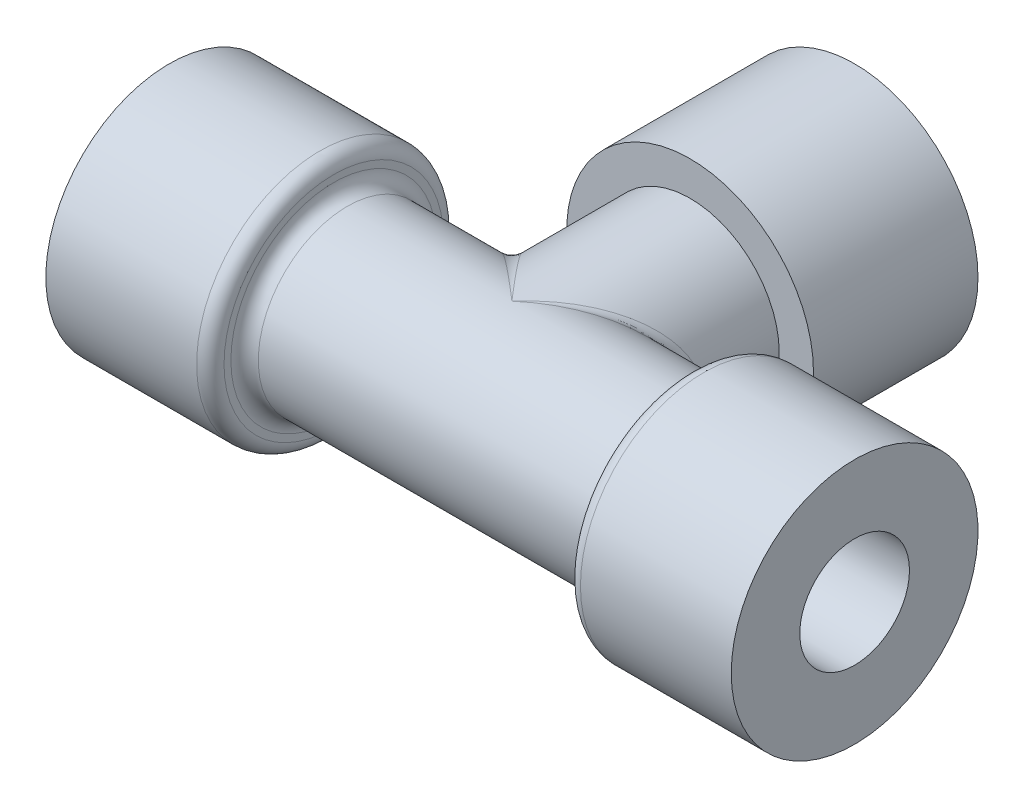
ISO-10303-21;
HEADER;
FILE_DESCRIPTION(('STEP AP214'),'2;1');
FILE_NAME('part.step','',(''),(''),'','','');
FILE_SCHEMA(('AUTOMOTIVE_DESIGN { 1 0 10303 214 1 1 1 1 }'));
ENDSEC;
DATA;
#1=APPLICATION_CONTEXT('core data for automotive mechanical design processes');
#2=APPLICATION_PROTOCOL_DEFINITION('international standard','automotive_design',2000,#1);
#3=PRODUCT_CONTEXT('',#1,'mechanical');
#4=PRODUCT('Part','Part','',(#3));
#5=PRODUCT_RELATED_PRODUCT_CATEGORY('part','',(#4));
#6=PRODUCT_DEFINITION_FORMATION('','',#4);
#7=PRODUCT_DEFINITION_CONTEXT('part definition',#1,'design');
#8=PRODUCT_DEFINITION('design','',#6,#7);
#9=PRODUCT_DEFINITION_SHAPE('','',#8);
#10=(LENGTH_UNIT() NAMED_UNIT(*) SI_UNIT(.MILLI.,.METRE.));
#11=(NAMED_UNIT(*) PLANE_ANGLE_UNIT() SI_UNIT($,.RADIAN.));
#12=(NAMED_UNIT(*) SI_UNIT($,.STERADIAN.) SOLID_ANGLE_UNIT());
#13=UNCERTAINTY_MEASURE_WITH_UNIT(LENGTH_MEASURE(1.E-05),#10,'distance_accuracy_value','');
#14=(GEOMETRIC_REPRESENTATION_CONTEXT(3) GLOBAL_UNCERTAINTY_ASSIGNED_CONTEXT((#13)) GLOBAL_UNIT_ASSIGNED_CONTEXT((#10,
#11,#12)) REPRESENTATION_CONTEXT('',''));
#15=CARTESIAN_POINT('',(0.,0.,0.));
#16=DIRECTION('',(0.,0.,1.));
#17=DIRECTION('',(1.,0.,0.));
#18=AXIS2_PLACEMENT_3D('',#15,#16,#17);
#19=CARTESIAN_POINT('',(0.,0.,0.));
#20=DIRECTION('',(1.,0.,0.));
#21=DIRECTION('',(0.,0.,-1.));
#22=AXIS2_PLACEMENT_3D('',#19,#20,#21);
#23=CYLINDRICAL_SURFACE('',#22,6.5);
#24=CARTESIAN_POINT('',(12.,0.,0.));
#25=DIRECTION('',(-1.,0.,0.));
#26=DIRECTION('',(0.,0.,1.));
#27=AXIS2_PLACEMENT_3D('',#24,#25,#26);
#28=CIRCLE('',#27,6.5);
#29=CARTESIAN_POINT('',(12.,0.,6.5));
#30=VERTEX_POINT('',#29);
#31=EDGE_CURVE('E123',#30,#30,#28,.T.);
#32=ORIENTED_EDGE('',*,*,#31,.T.);
#33=EDGE_LOOP('',(#32));
#34=FACE_BOUND('',#33,.T.);
#35=CARTESIAN_POINT('',(-12.,0.,0.));
#36=DIRECTION('',(1.,0.,0.));
#37=DIRECTION('',(0.,0.,-1.));
#38=AXIS2_PLACEMENT_3D('',#35,#36,#37);
#39=CIRCLE('',#38,6.5);
#40=CARTESIAN_POINT('',(-12.,0.,-6.5));
#41=VERTEX_POINT('',#40);
#42=EDGE_CURVE('E120',#41,#41,#39,.T.);
#43=ORIENTED_EDGE('',*,*,#42,.T.);
#44=EDGE_LOOP('',(#43));
#45=FACE_BOUND('',#44,.T.);
#46=CARTESIAN_POINT('',(0.,0.,0.));
#47=DIRECTION('',(0.654930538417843,0.,-0.755689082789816));
#48=DIRECTION('',(0.755689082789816,0.,0.654930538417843));
#49=AXIS2_PLACEMENT_3D('',#46,#47,#48);
#50=ELLIPSE('',#49,9.92471662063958,6.5);
#51=CARTESIAN_POINT('',(0.,6.5,0.));
#52=VERTEX_POINT('',#51);
#53=CARTESIAN_POINT('',(0.,-6.5,0.));
#54=VERTEX_POINT('',#53);
#55=EDGE_CURVE('E115',#52,#54,#50,.F.);
#56=ORIENTED_EDGE('',*,*,#55,.T.);
#57=CARTESIAN_POINT('',(0.,0.,0.));
#58=DIRECTION('',(-0.654930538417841,0.,-0.755689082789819));
#59=DIRECTION('',(0.755689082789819,0.,-0.654930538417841));
#60=AXIS2_PLACEMENT_3D('',#57,#58,#59);
#61=ELLIPSE('',#60,9.92471662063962,6.5);
#62=EDGE_CURVE('E117',#54,#52,#61,.F.);
#63=ORIENTED_EDGE('',*,*,#62,.T.);
#64=EDGE_LOOP('',(#56,#63));
#65=FACE_BOUND('',#64,.T.);
#66=ADVANCED_FACE('F34',(#34,#45,#65),#23,.T.);
#67=CARTESIAN_POINT('',(-13.,6.5,0.));
#68=DIRECTION('',(1.,0.,0.));
#69=DIRECTION('',(0.,0.,-1.));
#70=AXIS2_PLACEMENT_3D('',#67,#68,#69);
#71=PLANE('',#70);
#72=CARTESIAN_POINT('',(-13.,0.,0.));
#73=DIRECTION('',(1.,0.,0.));
#74=DIRECTION('',(0.,0.,-1.));
#75=AXIS2_PLACEMENT_3D('',#72,#73,#74);
#76=CIRCLE('',#75,8.);
#77=CARTESIAN_POINT('',(-13.,0.,-8.));
#78=VERTEX_POINT('',#77);
#79=EDGE_CURVE('E100',#78,#78,#76,.T.);
#80=ORIENTED_EDGE('',*,*,#79,.T.);
#81=EDGE_LOOP('',(#80));
#82=FACE_BOUND('',#81,.T.);
#83=CARTESIAN_POINT('',(-13.,0.,0.));
#84=DIRECTION('',(1.,0.,0.));
#85=DIRECTION('',(0.,0.,-1.));
#86=AXIS2_PLACEMENT_3D('',#83,#84,#85);
#87=CIRCLE('',#86,7.5);
#88=CARTESIAN_POINT('',(-13.,0.,-7.5));
#89=VERTEX_POINT('',#88);
#90=EDGE_CURVE('E97',#89,#89,#87,.F.);
#91=ORIENTED_EDGE('',*,*,#90,.T.);
#92=EDGE_LOOP('',(#91));
#93=FACE_BOUND('',#92,.T.);
#94=ADVANCED_FACE('F152',(#82,#93),#71,.T.);
#95=CARTESIAN_POINT('',(0.,0.,0.));
#96=DIRECTION('',(1.,0.,0.));
#97=DIRECTION('',(0.,0.,-1.));
#98=AXIS2_PLACEMENT_3D('',#95,#96,#97);
#99=CYLINDRICAL_SURFACE('',#98,9.);
#100=CARTESIAN_POINT('',(-14.,0.,0.));
#101=DIRECTION('',(1.,0.,0.));
#102=DIRECTION('',(0.,0.,-1.));
#103=AXIS2_PLACEMENT_3D('',#100,#101,#102);
#104=CIRCLE('',#103,9.);
#105=CARTESIAN_POINT('',(-14.,0.,-9.));
#106=VERTEX_POINT('',#105);
#107=EDGE_CURVE('E103',#106,#106,#104,.F.);
#108=ORIENTED_EDGE('',*,*,#107,.T.);
#109=EDGE_LOOP('',(#108));
#110=FACE_BOUND('',#109,.T.);
#111=CARTESIAN_POINT('',(-25.,0.,0.));
#112=DIRECTION('',(1.,0.,0.));
#113=DIRECTION('',(0.,0.,-1.));
#114=AXIS2_PLACEMENT_3D('',#111,#112,#113);
#115=CIRCLE('',#114,9.);
#116=CARTESIAN_POINT('',(-25.,0.,-9.));
#117=VERTEX_POINT('',#116);
#118=EDGE_CURVE('E94',#117,#117,#115,.T.);
#119=ORIENTED_EDGE('',*,*,#118,.T.);
#120=EDGE_LOOP('',(#119));
#121=FACE_BOUND('',#120,.T.);
#122=ADVANCED_FACE('F149',(#110,#121),#99,.T.);
#123=CARTESIAN_POINT('',(-25.,9.,0.));
#124=DIRECTION('',(-1.,0.,0.));
#125=DIRECTION('',(0.,0.,1.));
#126=AXIS2_PLACEMENT_3D('',#123,#124,#125);
#127=PLANE('',#126);
#128=CARTESIAN_POINT('',(-25.,0.,0.));
#129=DIRECTION('',(1.,0.,0.));
#130=DIRECTION('',(0.,0.,-1.));
#131=AXIS2_PLACEMENT_3D('',#128,#129,#130);
#132=CIRCLE('',#131,4.);
#133=CARTESIAN_POINT('',(-25.,0.,-4.));
#134=VERTEX_POINT('',#133);
#135=EDGE_CURVE('E77',#134,#134,#132,.T.);
#136=ORIENTED_EDGE('',*,*,#135,.T.);
#137=EDGE_LOOP('',(#136));
#138=FACE_BOUND('',#137,.T.);
#139=ORIENTED_EDGE('',*,*,#118,.F.);
#140=EDGE_LOOP('',(#139));
#141=FACE_BOUND('',#140,.T.);
#142=ADVANCED_FACE('F144',(#138,#141),#127,.T.);
#143=CARTESIAN_POINT('',(0.,0.,0.));
#144=DIRECTION('',(0.,0.,1.));
#145=DIRECTION('',(1.,0.,0.));
#146=AXIS2_PLACEMENT_3D('',#143,#144,#145);
#147=CYLINDRICAL_SURFACE('',#146,6.5);
#148=CARTESIAN_POINT('',(0.,0.,0.));
#149=DIRECTION('',(0.755689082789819,0.,-0.654930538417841));
#150=DIRECTION('',(0.654930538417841,0.,0.755689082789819));
#151=AXIS2_PLACEMENT_3D('',#148,#149,#150);
#152=ELLIPSE('',#151,9.92471662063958,6.5);
#153=EDGE_CURVE('E47',#54,#52,#152,.T.);
#154=ORIENTED_EDGE('',*,*,#153,.T.);
#155=CARTESIAN_POINT('',(0.,0.,0.));
#156=DIRECTION('',(-0.755689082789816,0.,-0.654930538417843));
#157=DIRECTION('',(0.654930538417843,0.,-0.755689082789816));
#158=AXIS2_PLACEMENT_3D('',#155,#156,#157);
#159=ELLIPSE('',#158,9.92471662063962,6.5);
#160=EDGE_CURVE('E11',#52,#54,#159,.T.);
#161=ORIENTED_EDGE('',*,*,#160,.T.);
#162=EDGE_LOOP('',(#154,#161));
#163=FACE_BOUND('',#162,.T.);
#164=CARTESIAN_POINT('',(0.,0.,-13.));
#165=DIRECTION('',(0.,0.,1.));
#166=DIRECTION('',(1.,0.,0.));
#167=AXIS2_PLACEMENT_3D('',#164,#165,#166);
#168=CIRCLE('',#167,6.5);
#169=CARTESIAN_POINT('',(6.50000000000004,0.,-13.));
#170=VERTEX_POINT('',#169);
#171=EDGE_CURVE('E91',#170,#170,#168,.T.);
#172=ORIENTED_EDGE('',*,*,#171,.T.);
#173=EDGE_LOOP('',(#172));
#174=FACE_BOUND('',#173,.T.);
#175=ADVANCED_FACE('F138',(#163,#174),#147,.T.);
#176=CARTESIAN_POINT('',(0.,6.5,-13.));
#177=DIRECTION('',(0.,0.,1.));
#178=DIRECTION('',(1.,0.,0.));
#179=AXIS2_PLACEMENT_3D('',#176,#177,#178);
#180=PLANE('',#179);
#181=CARTESIAN_POINT('',(0.,0.,-13.));
#182=DIRECTION('',(0.,0.,1.));
#183=DIRECTION('',(1.,0.,0.));
#184=AXIS2_PLACEMENT_3D('',#181,#182,#183);
#185=CIRCLE('',#184,9.);
#186=CARTESIAN_POINT('',(9.00000000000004,0.,-13.));
#187=VERTEX_POINT('',#186);
#188=EDGE_CURVE('E88',#187,#187,#185,.T.);
#189=ORIENTED_EDGE('',*,*,#188,.T.);
#190=EDGE_LOOP('',(#189));
#191=FACE_BOUND('',#190,.T.);
#192=ORIENTED_EDGE('',*,*,#171,.F.);
#193=EDGE_LOOP('',(#192));
#194=FACE_BOUND('',#193,.T.);
#195=ADVANCED_FACE('F143',(#191,#194),#180,.T.);
#196=CARTESIAN_POINT('',(0.,0.,0.));
#197=DIRECTION('',(0.,0.,1.));
#198=DIRECTION('',(1.,0.,0.));
#199=AXIS2_PLACEMENT_3D('',#196,#197,#198);
#200=CYLINDRICAL_SURFACE('',#199,9.);
#201=CARTESIAN_POINT('',(0.,0.,-25.));
#202=DIRECTION('',(0.,0.,1.));
#203=DIRECTION('',(1.,0.,0.));
#204=AXIS2_PLACEMENT_3D('',#201,#202,#203);
#205=CIRCLE('',#204,9.);
#206=CARTESIAN_POINT('',(9.00000000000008,0.,-25.));
#207=VERTEX_POINT('',#206);
#208=EDGE_CURVE('E85',#207,#207,#205,.T.);
#209=ORIENTED_EDGE('',*,*,#208,.T.);
#210=EDGE_LOOP('',(#209));
#211=FACE_BOUND('',#210,.T.);
#212=ORIENTED_EDGE('',*,*,#188,.F.);
#213=EDGE_LOOP('',(#212));
#214=FACE_BOUND('',#213,.T.);
#215=ADVANCED_FACE('F177',(#211,#214),#200,.T.);
#216=CARTESIAN_POINT('',(0.,9.,-25.));
#217=DIRECTION('',(0.,0.,-1.));
#218=DIRECTION('',(-1.,0.,0.));
#219=AXIS2_PLACEMENT_3D('',#216,#217,#218);
#220=PLANE('',#219);
#221=CARTESIAN_POINT('',(0.,0.,-25.));
#222=DIRECTION('',(0.,0.,-1.));
#223=DIRECTION('',(-1.,0.,0.));
#224=AXIS2_PLACEMENT_3D('',#221,#222,#223);
#225=CIRCLE('',#224,4.);
#226=CARTESIAN_POINT('',(-3.99999999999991,0.,-25.));
#227=VERTEX_POINT('',#226);
#228=EDGE_CURVE('E71',#227,#227,#225,.T.);
#229=ORIENTED_EDGE('',*,*,#228,.F.);
#230=EDGE_LOOP('',(#229));
#231=FACE_BOUND('',#230,.T.);
#232=ORIENTED_EDGE('',*,*,#208,.F.);
#233=EDGE_LOOP('',(#232));
#234=FACE_BOUND('',#233,.T.);
#235=ADVANCED_FACE('F182',(#231,#234),#220,.T.);
#236=CARTESIAN_POINT('',(13.,6.5,0.));
#237=DIRECTION('',(-1.,0.,0.));
#238=DIRECTION('',(0.,0.,1.));
#239=AXIS2_PLACEMENT_3D('',#236,#237,#238);
#240=PLANE('',#239);
#241=CARTESIAN_POINT('',(13.,0.,0.));
#242=DIRECTION('',(-1.,0.,0.));
#243=DIRECTION('',(0.,0.,1.));
#244=AXIS2_PLACEMENT_3D('',#241,#242,#243);
#245=CIRCLE('',#244,8.);
#246=CARTESIAN_POINT('',(13.,0.,8.));
#247=VERTEX_POINT('',#246);
#248=EDGE_CURVE('E109',#247,#247,#245,.T.);
#249=ORIENTED_EDGE('',*,*,#248,.T.);
#250=EDGE_LOOP('',(#249));
#251=FACE_BOUND('',#250,.T.);
#252=CARTESIAN_POINT('',(13.,0.,0.));
#253=DIRECTION('',(-1.,0.,0.));
#254=DIRECTION('',(0.,0.,1.));
#255=AXIS2_PLACEMENT_3D('',#252,#253,#254);
#256=CIRCLE('',#255,7.5);
#257=CARTESIAN_POINT('',(13.,0.,7.5));
#258=VERTEX_POINT('',#257);
#259=EDGE_CURVE('E106',#258,#258,#256,.F.);
#260=ORIENTED_EDGE('',*,*,#259,.T.);
#261=EDGE_LOOP('',(#260));
#262=FACE_BOUND('',#261,.T.);
#263=ADVANCED_FACE('F189',(#251,#262),#240,.T.);
#264=CARTESIAN_POINT('',(0.,0.,0.));
#265=DIRECTION('',(-1.,0.,0.));
#266=DIRECTION('',(0.,0.,1.));
#267=AXIS2_PLACEMENT_3D('',#264,#265,#266);
#268=CYLINDRICAL_SURFACE('',#267,9.);
#269=CARTESIAN_POINT('',(14.,0.,0.));
#270=DIRECTION('',(-1.,0.,0.));
#271=DIRECTION('',(0.,0.,1.));
#272=AXIS2_PLACEMENT_3D('',#269,#270,#271);
#273=CIRCLE('',#272,9.);
#274=CARTESIAN_POINT('',(14.,0.,9.));
#275=VERTEX_POINT('',#274);
#276=EDGE_CURVE('E112',#275,#275,#273,.F.);
#277=ORIENTED_EDGE('',*,*,#276,.T.);
#278=EDGE_LOOP('',(#277));
#279=FACE_BOUND('',#278,.T.);
#280=CARTESIAN_POINT('',(25.,0.,0.));
#281=DIRECTION('',(-1.,0.,0.));
#282=DIRECTION('',(0.,0.,1.));
#283=AXIS2_PLACEMENT_3D('',#280,#281,#282);
#284=CIRCLE('',#283,9.);
#285=CARTESIAN_POINT('',(25.,0.,9.));
#286=VERTEX_POINT('',#285);
#287=EDGE_CURVE('E80',#286,#286,#284,.T.);
#288=ORIENTED_EDGE('',*,*,#287,.T.);
#289=EDGE_LOOP('',(#288));
#290=FACE_BOUND('',#289,.T.);
#291=ADVANCED_FACE('F195',(#279,#290),#268,.T.);
#292=CARTESIAN_POINT('',(25.,9.,0.));
#293=DIRECTION('',(1.,0.,0.));
#294=DIRECTION('',(0.,0.,-1.));
#295=AXIS2_PLACEMENT_3D('',#292,#293,#294);
#296=PLANE('',#295);
#297=CARTESIAN_POINT('',(25.,0.,0.));
#298=DIRECTION('',(1.,0.,0.));
#299=DIRECTION('',(0.,0.,-1.));
#300=AXIS2_PLACEMENT_3D('',#297,#298,#299);
#301=CIRCLE('',#300,4.);
#302=CARTESIAN_POINT('',(25.,0.,-4.));
#303=VERTEX_POINT('',#302);
#304=EDGE_CURVE('E74',#303,#303,#301,.T.);
#305=ORIENTED_EDGE('',*,*,#304,.F.);
#306=EDGE_LOOP('',(#305));
#307=FACE_BOUND('',#306,.T.);
#308=ORIENTED_EDGE('',*,*,#287,.F.);
#309=EDGE_LOOP('',(#308));
#310=FACE_BOUND('',#309,.T.);
#311=ADVANCED_FACE('F199',(#307,#310),#296,.T.);
#312=CARTESIAN_POINT('',(-14.,0.,0.));
#313=DIRECTION('',(1.,0.,0.));
#314=DIRECTION('',(0.,0.,-1.));
#315=AXIS2_PLACEMENT_3D('',#312,#313,#314);
#316=TOROIDAL_SURFACE('',#315,8.,1.);
#317=ORIENTED_EDGE('',*,*,#107,.F.);
#318=EDGE_LOOP('',(#317));
#319=FACE_BOUND('',#318,.T.);
#320=ORIENTED_EDGE('',*,*,#79,.F.);
#321=EDGE_LOOP('',(#320));
#322=FACE_BOUND('',#321,.T.);
#323=ADVANCED_FACE('F203',(#319,#322),#316,.T.);
#324=CARTESIAN_POINT('',(14.,0.,0.));
#325=DIRECTION('',(-1.,0.,0.));
#326=DIRECTION('',(0.,0.,1.));
#327=AXIS2_PLACEMENT_3D('',#324,#325,#326);
#328=TOROIDAL_SURFACE('',#327,8.,1.);
#329=ORIENTED_EDGE('',*,*,#276,.F.);
#330=EDGE_LOOP('',(#329));
#331=FACE_BOUND('',#330,.T.);
#332=ORIENTED_EDGE('',*,*,#248,.F.);
#333=EDGE_LOOP('',(#332));
#334=FACE_BOUND('',#333,.T.);
#335=ADVANCED_FACE('F239',(#331,#334),#328,.T.);
#336=CARTESIAN_POINT('',(12.,0.,0.));
#337=DIRECTION('',(-1.,0.,0.));
#338=DIRECTION('',(0.,0.,1.));
#339=AXIS2_PLACEMENT_3D('',#336,#337,#338);
#340=TOROIDAL_SURFACE('',#339,7.5,1.);
#341=ORIENTED_EDGE('',*,*,#259,.F.);
#342=EDGE_LOOP('',(#341));
#343=FACE_BOUND('',#342,.T.);
#344=ORIENTED_EDGE('',*,*,#31,.F.);
#345=EDGE_LOOP('',(#344));
#346=FACE_BOUND('',#345,.T.);
#347=ADVANCED_FACE('F166',(#343,#346),#340,.F.);
#348=CARTESIAN_POINT('',(-12.,0.,0.));
#349=DIRECTION('',(1.,0.,0.));
#350=DIRECTION('',(0.,0.,-1.));
#351=AXIS2_PLACEMENT_3D('',#348,#349,#350);
#352=TOROIDAL_SURFACE('',#351,7.5,1.);
#353=ORIENTED_EDGE('',*,*,#90,.F.);
#354=EDGE_LOOP('',(#353));
#355=FACE_BOUND('',#354,.T.);
#356=ORIENTED_EDGE('',*,*,#42,.F.);
#357=EDGE_LOOP('',(#356));
#358=FACE_BOUND('',#357,.T.);
#359=ADVANCED_FACE('F132',(#355,#358),#352,.F.);
#360=CARTESIAN_POINT('',(0.,-6.5,0.));
#361=CARTESIAN_POINT('',(0.,-6.5,0.));
#362=CARTESIAN_POINT('',(0.,-6.5,0.));
#363=CARTESIAN_POINT('',(0.163400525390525,-6.49999184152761,-0.141613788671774));
#364=CARTESIAN_POINT('',(0.152507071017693,-6.50001104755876,-0.152507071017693));
#365=CARTESIAN_POINT('',(0.141613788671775,-6.49999184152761,-0.163400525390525));
#366=CARTESIAN_POINT('',(0.326777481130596,-6.49537217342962,-0.283207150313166));
#367=CARTESIAN_POINT('',(0.305100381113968,-6.49465557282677,-0.305100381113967));
#368=CARTESIAN_POINT('',(0.283207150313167,-6.49537217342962,-0.326777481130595));
#369=CARTESIAN_POINT('',(0.653194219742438,-6.4768548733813,-0.5661016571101));
#370=CARTESIAN_POINT('',(0.609617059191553,-6.47328806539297,-0.609617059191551));
#371=CARTESIAN_POINT('',(0.566101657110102,-6.4768548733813,-0.653194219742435));
#372=CARTESIAN_POINT('',(0.816233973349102,-6.46295646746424,-0.707402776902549));
#373=CARTESIAN_POINT('',(0.76175652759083,-6.45724469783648,-0.761756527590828));
#374=CARTESIAN_POINT('',(0.707402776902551,-6.46295646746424,-0.816233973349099));
#375=CARTESIAN_POINT('',(1.30150506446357,-6.40758889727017,-1.12797105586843));
#376=CARTESIAN_POINT('',(1.21447012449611,-6.39332621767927,-1.2144701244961));
#377=CARTESIAN_POINT('',(1.12797105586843,-6.40758889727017,-1.30150506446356));
#378=CARTESIAN_POINT('',(1.622777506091,-6.35244771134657,-1.40640717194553));
#379=CARTESIAN_POINT('',(1.51403405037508,-6.32945791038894,-1.51403405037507));
#380=CARTESIAN_POINT('',(1.40640717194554,-6.35244771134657,-1.622777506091));
#381=CARTESIAN_POINT('',(2.2541682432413,-6.20582805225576,-1.95361247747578));
#382=CARTESIAN_POINT('',(2.09881319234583,-6.16110583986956,-2.09881319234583));
#383=CARTESIAN_POINT('',(1.95361247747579,-6.20582805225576,-2.25416824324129));
#384=CARTESIAN_POINT('',(2.56438324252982,-6.11497457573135,-2.22246547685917));
#385=CARTESIAN_POINT('',(2.38573618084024,-6.05638189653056,-2.38573618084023));
#386=CARTESIAN_POINT('',(2.22246547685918,-6.11497457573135,-2.56438324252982));
#387=CARTESIAN_POINT('',(3.16833646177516,-5.89816315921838,-2.74589160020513));
#388=CARTESIAN_POINT('',(2.93929436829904,-5.80909169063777,-2.93929436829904));
#389=CARTESIAN_POINT('',(2.74589160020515,-5.89816315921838,-3.16833646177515));
#390=CARTESIAN_POINT('',(3.46229232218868,-5.7731251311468,-3.00065334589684));
#391=CARTESIAN_POINT('',(3.20758116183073,-5.66617507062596,-3.20758116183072));
#392=CARTESIAN_POINT('',(3.00065334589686,-5.7731251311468,-3.46229232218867));
#393=CARTESIAN_POINT('',(4.02854992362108,-5.48978737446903,-3.49140993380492));
#394=CARTESIAN_POINT('',(3.7182383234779,-5.34644239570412,-3.71823832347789));
#395=CARTESIAN_POINT('',(3.49140993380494,-5.48978737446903,-4.02854992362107));
#396=CARTESIAN_POINT('',(4.3012430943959,-5.33267305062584,-3.7277440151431));
#397=CARTESIAN_POINT('',(3.96215720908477,-5.16919195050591,-3.96215720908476));
#398=CARTESIAN_POINT('',(3.72774401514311,-5.33267305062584,-4.30124309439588));
#399=CARTESIAN_POINT('',(4.82013028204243,-4.98760253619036,-4.17744624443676));
#400=CARTESIAN_POINT('',(4.4191020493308,-4.78599293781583,-4.41910204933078));
#401=CARTESIAN_POINT('',(4.17744624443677,-4.98760253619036,-4.82013028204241));
#402=CARTESIAN_POINT('',(5.06693746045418,-4.80104493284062,-4.39134579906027));
#403=CARTESIAN_POINT('',(4.63350626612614,-4.57958418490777,-4.63350626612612));
#404=CARTESIAN_POINT('',(4.39134579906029,-4.80104493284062,-5.06693746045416));
#405=CARTESIAN_POINT('',(5.52959467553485,-4.40007030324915,-4.79231538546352));
#406=CARTESIAN_POINT('',(5.02743788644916,-4.14454522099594,-5.02743788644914));
#407=CARTESIAN_POINT('',(4.79231538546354,-4.40007030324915,-5.52959467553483));
#408=CARTESIAN_POINT('',(5.74631561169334,-4.18717873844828,-4.98014019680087));
#409=CARTESIAN_POINT('',(5.20809186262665,-3.91553743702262,-5.20809186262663));
#410=CARTESIAN_POINT('',(4.9801401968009,-4.18717873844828,-5.74631561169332));
#411=CARTESIAN_POINT('',(6.14482253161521,-3.737068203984,-5.32551286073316));
#412=CARTESIAN_POINT('',(5.53205846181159,-3.4428461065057,-5.53205846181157));
#413=CARTESIAN_POINT('',(5.32551286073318,-3.737068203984,-6.14482253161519));
#414=CARTESIAN_POINT('',(6.32774092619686,-3.50137281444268,-5.48404213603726));
#415=CARTESIAN_POINT('',(5.67616757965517,-3.19903898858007,-5.67616757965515));
#416=CARTESIAN_POINT('',(5.48404213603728,-3.50137281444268,-6.32774092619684));
#417=CARTESIAN_POINT('',(6.65524486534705,-3.00972884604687,-5.76787888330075));
#418=CARTESIAN_POINT('',(5.9267034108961,-2.70464998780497,-5.92670341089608));
#419=CARTESIAN_POINT('',(5.76787888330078,-3.00972884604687,-6.65524486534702));
#420=CARTESIAN_POINT('',(6.80116656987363,-2.7551344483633,-5.89434436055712));
#421=CARTESIAN_POINT('',(6.03355436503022,-2.45442362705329,-6.0335543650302));
#422=CARTESIAN_POINT('',(5.89434436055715,-2.7551344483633,-6.80116656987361));
#423=CARTESIAN_POINT('',(7.05198947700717,-2.23028992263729,-6.1117242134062));
#424=CARTESIAN_POINT('',(6.21173323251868,-1.95393910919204,-6.21173323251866));
#425=CARTESIAN_POINT('',(6.11172421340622,-2.23028992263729,-7.05198947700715));
#426=CARTESIAN_POINT('',(7.15827955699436,-1.96105087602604,-6.20384228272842));
#427=CARTESIAN_POINT('',(6.28314807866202,-1.70473827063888,-6.283148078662));
#428=CARTESIAN_POINT('',(6.20384228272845,-1.96105087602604,-7.15827955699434));
#429=CARTESIAN_POINT('',(7.32802063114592,-1.41196590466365,-6.35095121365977));
#430=CARTESIAN_POINT('',(6.39461502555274,-1.20974382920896,-6.39461502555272));
#431=CARTESIAN_POINT('',(6.3509512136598,-1.41196590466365,-7.32802063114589));
#432=CARTESIAN_POINT('',(7.39266210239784,-1.13268121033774,-6.4069738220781));
#433=CARTESIAN_POINT('',(6.43454952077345,-0.965815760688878,-6.43454952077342));
#434=CARTESIAN_POINT('',(6.40697382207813,-1.13268121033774,-7.39266210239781));
#435=CARTESIAN_POINT('',(7.47830247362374,-0.568823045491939,-6.48119547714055));
#436=CARTESIAN_POINT('',(6.48730756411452,-0.480033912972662,-6.48730756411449));
#437=CARTESIAN_POINT('',(6.48119547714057,-0.568823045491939,-7.47830247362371));
#438=CARTESIAN_POINT('',(7.50000000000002,-0.284411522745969,-6.5));
#439=CARTESIAN_POINT('',(6.50000000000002,-0.240717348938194,-6.5));
#440=CARTESIAN_POINT('',(6.50000000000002,-0.284411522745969,-7.5));
#441=CARTESIAN_POINT('',(7.50000000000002,0.284411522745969,-6.5));
#442=CARTESIAN_POINT('',(6.50000000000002,0.240717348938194,-6.5));
#443=CARTESIAN_POINT('',(6.50000000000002,0.284411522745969,-7.5));
#444=CARTESIAN_POINT('',(7.47830247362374,0.568823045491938,-6.48119547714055));
#445=CARTESIAN_POINT('',(6.48730756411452,0.480033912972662,-6.48730756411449));
#446=CARTESIAN_POINT('',(6.48119547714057,0.568823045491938,-7.47830247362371));
#447=CARTESIAN_POINT('',(7.39266210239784,1.13268121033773,-6.4069738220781));
#448=CARTESIAN_POINT('',(6.43454952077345,0.965815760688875,-6.43454952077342));
#449=CARTESIAN_POINT('',(6.40697382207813,1.13268121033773,-7.39266210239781));
#450=CARTESIAN_POINT('',(7.32802063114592,1.41196590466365,-6.35095121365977));
#451=CARTESIAN_POINT('',(6.39461502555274,1.20974382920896,-6.39461502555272));
#452=CARTESIAN_POINT('',(6.3509512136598,1.41196590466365,-7.32802063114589));
#453=CARTESIAN_POINT('',(7.15827955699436,1.96105087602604,-6.20384228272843));
#454=CARTESIAN_POINT('',(6.28314807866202,1.70473827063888,-6.283148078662));
#455=CARTESIAN_POINT('',(6.20384228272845,1.96105087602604,-7.15827955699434));
#456=CARTESIAN_POINT('',(7.05198947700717,2.23028992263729,-6.1117242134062));
#457=CARTESIAN_POINT('',(6.21173323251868,1.95393910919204,-6.21173323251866));
#458=CARTESIAN_POINT('',(6.11172421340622,2.23028992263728,-7.05198947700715));
#459=CARTESIAN_POINT('',(6.80116656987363,2.7551344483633,-5.89434436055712));
#460=CARTESIAN_POINT('',(6.03355436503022,2.45442362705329,-6.0335543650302));
#461=CARTESIAN_POINT('',(5.89434436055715,2.7551344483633,-6.80116656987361));
#462=CARTESIAN_POINT('',(6.65524486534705,3.00972884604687,-5.76787888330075));
#463=CARTESIAN_POINT('',(5.9267034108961,2.70464998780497,-5.92670341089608));
#464=CARTESIAN_POINT('',(5.76787888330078,3.00972884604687,-6.65524486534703));
#465=CARTESIAN_POINT('',(6.32774092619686,3.50137281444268,-5.48404213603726));
#466=CARTESIAN_POINT('',(5.67616757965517,3.19903898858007,-5.67616757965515));
#467=CARTESIAN_POINT('',(5.48404213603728,3.50137281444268,-6.32774092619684));
#468=CARTESIAN_POINT('',(6.14482253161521,3.73706820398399,-5.32551286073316));
#469=CARTESIAN_POINT('',(5.53205846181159,3.4428461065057,-5.53205846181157));
#470=CARTESIAN_POINT('',(5.32551286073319,3.73706820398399,-6.14482253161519));
#471=CARTESIAN_POINT('',(5.74631561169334,4.18717873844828,-4.98014019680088));
#472=CARTESIAN_POINT('',(5.20809186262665,3.91553743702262,-5.20809186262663));
#473=CARTESIAN_POINT('',(4.9801401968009,4.18717873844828,-5.74631561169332));
#474=CARTESIAN_POINT('',(5.52959467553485,4.40007030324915,-4.79231538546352));
#475=CARTESIAN_POINT('',(5.02743788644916,4.14454522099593,-5.02743788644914));
#476=CARTESIAN_POINT('',(4.79231538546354,4.40007030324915,-5.52959467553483));
#477=CARTESIAN_POINT('',(5.06693746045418,4.80104493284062,-4.39134579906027));
#478=CARTESIAN_POINT('',(4.63350626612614,4.57958418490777,-4.63350626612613));
#479=CARTESIAN_POINT('',(4.39134579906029,4.80104493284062,-5.06693746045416));
#480=CARTESIAN_POINT('',(4.82013028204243,4.98760253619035,-4.17744624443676));
#481=CARTESIAN_POINT('',(4.4191020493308,4.78599293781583,-4.41910204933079));
#482=CARTESIAN_POINT('',(4.17744624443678,4.98760253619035,-4.82013028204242));
#483=CARTESIAN_POINT('',(4.3012430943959,5.33267305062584,-3.7277440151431));
#484=CARTESIAN_POINT('',(3.96215720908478,5.16919195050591,-3.96215720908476));
#485=CARTESIAN_POINT('',(3.72774401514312,5.33267305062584,-4.30124309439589));
#486=CARTESIAN_POINT('',(4.02854992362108,5.48978737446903,-3.49140993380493));
#487=CARTESIAN_POINT('',(3.7182383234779,5.34644239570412,-3.71823832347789));
#488=CARTESIAN_POINT('',(3.49140993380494,5.48978737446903,-4.02854992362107));
#489=CARTESIAN_POINT('',(3.46229232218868,5.7731251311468,-3.00065334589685));
#490=CARTESIAN_POINT('',(3.20758116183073,5.66617507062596,-3.20758116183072));
#491=CARTESIAN_POINT('',(3.00065334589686,5.7731251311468,-3.46229232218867));
#492=CARTESIAN_POINT('',(3.16833646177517,5.89816315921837,-2.74589160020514));
#493=CARTESIAN_POINT('',(2.93929436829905,5.80909169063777,-2.93929436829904));
#494=CARTESIAN_POINT('',(2.74589160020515,5.89816315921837,-3.16833646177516));
#495=CARTESIAN_POINT('',(2.56438324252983,6.11497457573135,-2.22246547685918));
#496=CARTESIAN_POINT('',(2.38573618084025,6.05638189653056,-2.38573618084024));
#497=CARTESIAN_POINT('',(2.22246547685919,6.11497457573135,-2.56438324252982));
#498=CARTESIAN_POINT('',(2.2541682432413,6.20582805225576,-1.95361247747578));
#499=CARTESIAN_POINT('',(2.09881319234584,6.16110583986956,-2.09881319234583));
#500=CARTESIAN_POINT('',(1.95361247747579,6.20582805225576,-2.25416824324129));
#501=CARTESIAN_POINT('',(1.622777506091,6.35244771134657,-1.40640717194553));
#502=CARTESIAN_POINT('',(1.51403405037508,6.32945791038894,-1.51403405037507));
#503=CARTESIAN_POINT('',(1.40640717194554,6.35244771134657,-1.622777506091));
#504=CARTESIAN_POINT('',(1.30150506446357,6.40758889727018,-1.12797105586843));
#505=CARTESIAN_POINT('',(1.21447012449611,6.39332621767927,-1.21447012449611));
#506=CARTESIAN_POINT('',(1.12797105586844,6.40758889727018,-1.30150506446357));
#507=CARTESIAN_POINT('',(0.816233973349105,6.46295646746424,-0.707402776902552));
#508=CARTESIAN_POINT('',(0.761756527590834,6.45724469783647,-0.761756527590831));
#509=CARTESIAN_POINT('',(0.707402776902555,6.46295646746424,-0.816233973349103));
#510=CARTESIAN_POINT('',(0.653194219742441,6.4768548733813,-0.566101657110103));
#511=CARTESIAN_POINT('',(0.609617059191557,6.47328806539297,-0.609617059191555));
#512=CARTESIAN_POINT('',(0.566101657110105,6.4768548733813,-0.65319421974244));
#513=CARTESIAN_POINT('',(0.326777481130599,6.49537217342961,-0.283207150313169));
#514=CARTESIAN_POINT('',(0.305100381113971,6.49465557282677,-0.30510038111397));
#515=CARTESIAN_POINT('',(0.28320715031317,6.49537217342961,-0.326777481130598));
#516=CARTESIAN_POINT('',(0.163400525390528,6.49999184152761,-0.141613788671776));
#517=CARTESIAN_POINT('',(0.152507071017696,6.50001104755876,-0.152507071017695));
#518=CARTESIAN_POINT('',(0.141613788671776,6.49999184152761,-0.163400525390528));
#519=CARTESIAN_POINT('',(0.,6.5,0.));
#520=CARTESIAN_POINT('',(0.,6.5,0.));
#521=CARTESIAN_POINT('',(0.,6.5,0.));
#522=(BOUNDED_SURFACE() B_SPLINE_SURFACE(3,2,((#360,#361,#362),(#363,#364,#365),(#366,#367,
#368),(#369,#370,#371),(#372,#373,#374),(#375,#376,#377),(#378,#379,#380),(#381,#382,#383),
(#384,#385,#386),(#387,#388,#389),(#390,#391,#392),(#393,#394,#395),(#396,#397,#398),(#399,#400,
#401),(#402,#403,#404),(#405,#406,#407),(#408,#409,#410),(#411,#412,#413),(#414,#415,#416),
(#417,#418,#419),(#420,#421,#422),(#423,#424,#425),(#426,#427,#428),(#429,#430,#431),(#432,#433,
#434),(#435,#436,#437),(#438,#439,#440),(#441,#442,#443),(#444,#445,#446),(#447,#448,#449),
(#450,#451,#452),(#453,#454,#455),(#456,#457,#458),(#459,#460,#461),(#462,#463,#464),(#465,#466,
#467),(#468,#469,#470),(#471,#472,#473),(#474,#475,#476),(#477,#478,#479),(#480,#481,#482),
(#483,#484,#485),(#486,#487,#488),(#489,#490,#491),(#492,#493,#494),(#495,#496,#497),(#498,#499,
#500),(#501,#502,#503),(#504,#505,#506),(#507,#508,#509),(#510,#511,#512),(#513,#514,#515),
(#516,#517,#518),(#519,#520,#521)),.UNSPECIFIED.,.F.,.F.,.F.) B_SPLINE_SURFACE_WITH_KNOTS((4,2,
2,2,2,2,2,2,2,2,2,2,2,2,2,2,2,2,2,2,2,2,2,2,2,2,4),(3,3),(0.,0.693120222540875,1.38629826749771,
2.76044345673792,4.11154017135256,5.42935343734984,6.70522062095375,7.93261310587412,
9.1077160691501,10.2300004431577,11.3027201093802,12.333203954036,13.3327459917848,
14.3158889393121,15.2990318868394,16.2985739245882,17.3290577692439,18.4017774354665,
19.5240618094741,20.69916477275,21.9265572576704,23.2024244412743,24.5202377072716,
25.8713344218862,27.2454796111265,27.9386576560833,28.6317778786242),(0.,1.),
.UNSPECIFIED.) GEOMETRIC_REPRESENTATION_ITEM() RATIONAL_B_SPLINE_SURFACE(((1.,1.,1.),(1.,
0.999999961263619,1.),(1.,0.999643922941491,1.),(1.,0.998220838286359,1.),(1.,0.997153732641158,
1.),(1.,0.992912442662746,1.),(1.,0.988698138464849,1.),(1.,0.977616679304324,1.),(1.,
0.970795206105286,1.),(1.,0.954789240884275,1.),(1.,0.945667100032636,1.),(1.,0.925487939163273,
1.),(1.,0.914501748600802,1.),(1.,0.891170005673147,1.),(1.,0.878891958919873,1.),(1.,
0.853706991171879,1.),(1.,0.84084914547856,1.),(1.,0.815387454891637,1.),(1.,0.802798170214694,
1.),(1.,0.778880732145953,1.),(1.,0.767521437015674,1.),(1.,0.747118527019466,1.),(1.,
0.738001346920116,1.),(1.,0.723039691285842,1.),(1.,0.71710516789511,1.),(1.,0.709170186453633,
1.),(1.,0.707106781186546,1.),(1.,0.707106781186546,1.),(1.,0.709170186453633,1.),(1.,
0.71710516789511,1.),(1.,0.723039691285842,1.),(1.,0.738001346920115,1.),(1.,0.747118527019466,
1.),(1.,0.767521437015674,1.),(1.,0.778880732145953,1.),(1.,0.802798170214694,1.),(1.,
0.815387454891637,1.),(1.,0.84084914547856,1.),(1.,0.853706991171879,1.),(1.,0.878891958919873,
1.),(1.,0.891170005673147,1.),(1.,0.914501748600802,1.),(1.,0.925487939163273,1.),(1.,
0.945667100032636,1.),(1.,0.954789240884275,1.),(1.,0.970795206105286,1.),(1.,0.977616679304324,
1.),(1.,0.988698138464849,1.),(1.,0.992912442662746,1.),(1.,0.997153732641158,1.),(1.,
0.998220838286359,1.),(1.,0.999643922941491,1.),(1.,0.999999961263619,1.),(1.,1.,1.))) REPRESENTATION_ITEM('') SURFACE());
#523=ORIENTED_EDGE('',*,*,#62,.F.);
#524=ORIENTED_EDGE('',*,*,#160,.F.);
#525=EDGE_LOOP('',(#523,#524));
#526=FACE_BOUND('',#525,.T.);
#527=ADVANCED_FACE('F127',(#526),#522,.F.);
#528=CARTESIAN_POINT('',(0.,6.5,0.));
#529=CARTESIAN_POINT('',(0.,6.5,0.));
#530=CARTESIAN_POINT('',(0.,6.5,0.));
#531=CARTESIAN_POINT('',(-0.163400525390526,6.49999184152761,-0.141613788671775));
#532=CARTESIAN_POINT('',(-0.152507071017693,6.50001104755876,-0.152507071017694));
#533=CARTESIAN_POINT('',(-0.141613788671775,6.49999184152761,-0.163400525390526));
#534=CARTESIAN_POINT('',(-0.326777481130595,6.49537217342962,-0.283207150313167));
#535=CARTESIAN_POINT('',(-0.305100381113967,6.49465557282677,-0.305100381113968));
#536=CARTESIAN_POINT('',(-0.283207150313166,6.49537217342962,-0.326777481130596));
#537=CARTESIAN_POINT('',(-0.653194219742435,6.4768548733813,-0.566101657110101));
#538=CARTESIAN_POINT('',(-0.60961705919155,6.47328806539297,-0.609617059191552));
#539=CARTESIAN_POINT('',(-0.566101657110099,6.4768548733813,-0.653194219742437));
#540=CARTESIAN_POINT('',(-0.816233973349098,6.46295646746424,-0.70740277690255));
#541=CARTESIAN_POINT('',(-0.761756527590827,6.45724469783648,-0.761756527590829));
#542=CARTESIAN_POINT('',(-0.707402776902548,6.46295646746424,-0.816233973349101));
#543=CARTESIAN_POINT('',(-1.30150506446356,6.40758889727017,-1.12797105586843));
#544=CARTESIAN_POINT('',(-1.2144701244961,6.39332621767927,-1.21447012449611));
#545=CARTESIAN_POINT('',(-1.12797105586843,6.40758889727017,-1.30150506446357));
#546=CARTESIAN_POINT('',(-1.62277750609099,6.35244771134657,-1.40640717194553));
#547=CARTESIAN_POINT('',(-1.51403405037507,6.32945791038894,-1.51403405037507));
#548=CARTESIAN_POINT('',(-1.40640717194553,6.35244771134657,-1.622777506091));
#549=CARTESIAN_POINT('',(-2.25416824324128,6.20582805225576,-1.95361247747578));
#550=CARTESIAN_POINT('',(-2.09881319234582,6.16110583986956,-2.09881319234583));
#551=CARTESIAN_POINT('',(-1.95361247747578,6.20582805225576,-2.25416824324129));
#552=CARTESIAN_POINT('',(-2.56438324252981,6.11497457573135,-2.22246547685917));
#553=CARTESIAN_POINT('',(-2.38573618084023,6.05638189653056,-2.38573618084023));
#554=CARTESIAN_POINT('',(-2.22246547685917,6.11497457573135,-2.56438324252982));
#555=CARTESIAN_POINT('',(-3.16833646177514,5.89816315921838,-2.74589160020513));
#556=CARTESIAN_POINT('',(-2.93929436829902,5.80909169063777,-2.93929436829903));
#557=CARTESIAN_POINT('',(-2.74589160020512,5.89816315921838,-3.16833646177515));
#558=CARTESIAN_POINT('',(-3.46229232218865,5.7731251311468,-3.00065334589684));
#559=CARTESIAN_POINT('',(-3.2075811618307,5.66617507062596,-3.20758116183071));
#560=CARTESIAN_POINT('',(-3.00065334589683,5.7731251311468,-3.46229232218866));
#561=CARTESIAN_POINT('',(-4.02854992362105,5.48978737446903,-3.49140993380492));
#562=CARTESIAN_POINT('',(-3.71823832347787,5.34644239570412,-3.71823832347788));
#563=CARTESIAN_POINT('',(-3.49140993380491,5.48978737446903,-4.02854992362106));
#564=CARTESIAN_POINT('',(-4.30124309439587,5.33267305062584,-3.7277440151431));
#565=CARTESIAN_POINT('',(-3.96215720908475,5.16919195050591,-3.96215720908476));
#566=CARTESIAN_POINT('',(-3.72774401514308,5.33267305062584,-4.30124309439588));
#567=CARTESIAN_POINT('',(-4.8201302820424,4.98760253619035,-4.17744624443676));
#568=CARTESIAN_POINT('',(-4.41910204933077,4.78599293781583,-4.41910204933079));
#569=CARTESIAN_POINT('',(-4.17744624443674,4.98760253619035,-4.82013028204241));
#570=CARTESIAN_POINT('',(-5.06693746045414,4.80104493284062,-4.39134579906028));
#571=CARTESIAN_POINT('',(-4.63350626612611,4.57958418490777,-4.63350626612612));
#572=CARTESIAN_POINT('',(-4.39134579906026,4.80104493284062,-5.06693746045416));
#573=CARTESIAN_POINT('',(-5.52959467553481,4.40007030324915,-4.79231538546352));
#574=CARTESIAN_POINT('',(-5.02743788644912,4.14454522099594,-5.02743788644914));
#575=CARTESIAN_POINT('',(-4.7923153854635,4.40007030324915,-5.52959467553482));
#576=CARTESIAN_POINT('',(-5.7463156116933,4.18717873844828,-4.98014019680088));
#577=CARTESIAN_POINT('',(-5.20809186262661,3.91553743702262,-5.20809186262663));
#578=CARTESIAN_POINT('',(-4.98014019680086,4.18717873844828,-5.74631561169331));
#579=CARTESIAN_POINT('',(-6.14482253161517,3.73706820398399,-5.32551286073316));
#580=CARTESIAN_POINT('',(-5.53205846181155,3.4428461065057,-5.53205846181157));
#581=CARTESIAN_POINT('',(-5.32551286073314,3.73706820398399,-6.14482253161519));
#582=CARTESIAN_POINT('',(-6.32774092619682,3.50137281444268,-5.48404213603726));
#583=CARTESIAN_POINT('',(-5.67616757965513,3.19903898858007,-5.67616757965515));
#584=CARTESIAN_POINT('',(-5.48404213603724,3.50137281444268,-6.32774092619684));
#585=CARTESIAN_POINT('',(-6.655244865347,3.00972884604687,-5.76787888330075));
#586=CARTESIAN_POINT('',(-5.92670341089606,2.70464998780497,-5.92670341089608));
#587=CARTESIAN_POINT('',(-5.76787888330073,3.00972884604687,-6.65524486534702));
#588=CARTESIAN_POINT('',(-6.80116656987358,2.7551344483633,-5.89434436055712));
#589=CARTESIAN_POINT('',(-6.03355436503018,2.4544236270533,-6.0335543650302));
#590=CARTESIAN_POINT('',(-5.8943443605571,2.7551344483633,-6.8011665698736));
#591=CARTESIAN_POINT('',(-7.05198947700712,2.23028992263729,-6.1117242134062));
#592=CARTESIAN_POINT('',(-6.21173323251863,1.95393910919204,-6.21173323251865));
#593=CARTESIAN_POINT('',(-6.11172421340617,2.23028992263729,-7.05198947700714));
#594=CARTESIAN_POINT('',(-7.15827955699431,1.96105087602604,-6.20384228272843));
#595=CARTESIAN_POINT('',(-6.28314807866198,1.70473827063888,-6.283148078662));
#596=CARTESIAN_POINT('',(-6.2038422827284,1.96105087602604,-7.15827955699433));
#597=CARTESIAN_POINT('',(-7.32802063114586,1.41196590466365,-6.35095121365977));
#598=CARTESIAN_POINT('',(-6.39461502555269,1.20974382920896,-6.39461502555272));
#599=CARTESIAN_POINT('',(-6.35095121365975,1.41196590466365,-7.32802063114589));
#600=CARTESIAN_POINT('',(-7.39266210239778,1.13268121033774,-6.4069738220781));
#601=CARTESIAN_POINT('',(-6.4345495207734,0.96581576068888,-6.43454952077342));
#602=CARTESIAN_POINT('',(-6.40697382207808,1.13268121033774,-7.39266210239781));
#603=CARTESIAN_POINT('',(-7.47830247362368,0.56882304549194,-6.48119547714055));
#604=CARTESIAN_POINT('',(-6.48730756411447,0.480033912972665,-6.48730756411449));
#605=CARTESIAN_POINT('',(-6.48119547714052,0.56882304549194,-7.47830247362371));
#606=CARTESIAN_POINT('',(-7.49999999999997,0.284411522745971,-6.5));
#607=CARTESIAN_POINT('',(-6.49999999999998,0.240717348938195,-6.5));
#608=CARTESIAN_POINT('',(-6.49999999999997,0.284411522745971,-7.49999999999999));
#609=CARTESIAN_POINT('',(-7.49999999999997,-0.284411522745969,-6.5));
#610=CARTESIAN_POINT('',(-6.49999999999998,-0.240717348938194,-6.5));
#611=CARTESIAN_POINT('',(-6.49999999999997,-0.284411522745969,-7.49999999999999));
#612=CARTESIAN_POINT('',(-7.47830247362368,-0.568823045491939,-6.48119547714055));
#613=CARTESIAN_POINT('',(-6.48730756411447,-0.480033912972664,-6.48730756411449));
#614=CARTESIAN_POINT('',(-6.48119547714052,-0.568823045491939,-7.47830247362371));
#615=CARTESIAN_POINT('',(-7.39266210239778,-1.13268121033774,-6.4069738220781));
#616=CARTESIAN_POINT('',(-6.4345495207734,-0.965815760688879,-6.43454952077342));
#617=CARTESIAN_POINT('',(-6.40697382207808,-1.13268121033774,-7.39266210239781));
#618=CARTESIAN_POINT('',(-7.32802063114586,-1.41196590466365,-6.35095121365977));
#619=CARTESIAN_POINT('',(-6.3946150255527,-1.20974382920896,-6.39461502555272));
#620=CARTESIAN_POINT('',(-6.35095121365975,-1.41196590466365,-7.32802063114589));
#621=CARTESIAN_POINT('',(-7.15827955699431,-1.96105087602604,-6.20384228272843));
#622=CARTESIAN_POINT('',(-6.28314807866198,-1.70473827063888,-6.283148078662));
#623=CARTESIAN_POINT('',(-6.2038422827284,-1.96105087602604,-7.15827955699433));
#624=CARTESIAN_POINT('',(-7.05198947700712,-2.23028992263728,-6.1117242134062));
#625=CARTESIAN_POINT('',(-6.21173323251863,-1.95393910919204,-6.21173323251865));
#626=CARTESIAN_POINT('',(-6.11172421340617,-2.23028992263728,-7.05198947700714));
#627=CARTESIAN_POINT('',(-6.80116656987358,-2.7551344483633,-5.89434436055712));
#628=CARTESIAN_POINT('',(-6.03355436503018,-2.45442362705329,-6.0335543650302));
#629=CARTESIAN_POINT('',(-5.8943443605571,-2.7551344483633,-6.8011665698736));
#630=CARTESIAN_POINT('',(-6.655244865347,-3.00972884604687,-5.76787888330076));
#631=CARTESIAN_POINT('',(-5.92670341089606,-2.70464998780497,-5.92670341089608));
#632=CARTESIAN_POINT('',(-5.76787888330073,-3.00972884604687,-6.65524486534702));
#633=CARTESIAN_POINT('',(-6.32774092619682,-3.50137281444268,-5.48404213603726));
#634=CARTESIAN_POINT('',(-5.67616757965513,-3.19903898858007,-5.67616757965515));
#635=CARTESIAN_POINT('',(-5.48404213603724,-3.50137281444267,-6.32774092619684));
#636=CARTESIAN_POINT('',(-6.14482253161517,-3.73706820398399,-5.32551286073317));
#637=CARTESIAN_POINT('',(-5.53205846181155,-3.4428461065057,-5.53205846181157));
#638=CARTESIAN_POINT('',(-5.32551286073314,-3.73706820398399,-6.14482253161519));
#639=CARTESIAN_POINT('',(-5.7463156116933,-4.18717873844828,-4.98014019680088));
#640=CARTESIAN_POINT('',(-5.20809186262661,-3.91553743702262,-5.20809186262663));
#641=CARTESIAN_POINT('',(-4.98014019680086,-4.18717873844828,-5.74631561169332));
#642=CARTESIAN_POINT('',(-5.52959467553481,-4.40007030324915,-4.79231538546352));
#643=CARTESIAN_POINT('',(-5.02743788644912,-4.14454522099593,-5.02743788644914));
#644=CARTESIAN_POINT('',(-4.7923153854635,-4.40007030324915,-5.52959467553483));
#645=CARTESIAN_POINT('',(-5.06693746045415,-4.80104493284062,-4.39134579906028));
#646=CARTESIAN_POINT('',(-4.63350626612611,-4.57958418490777,-4.63350626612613));
#647=CARTESIAN_POINT('',(-4.39134579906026,-4.80104493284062,-5.06693746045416));
#648=CARTESIAN_POINT('',(-4.8201302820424,-4.98760253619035,-4.17744624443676));
#649=CARTESIAN_POINT('',(-4.41910204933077,-4.78599293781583,-4.41910204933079));
#650=CARTESIAN_POINT('',(-4.17744624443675,-4.98760253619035,-4.82013028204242));
#651=CARTESIAN_POINT('',(-4.30124309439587,-5.33267305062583,-3.7277440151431));
#652=CARTESIAN_POINT('',(-3.96215720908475,-5.16919195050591,-3.96215720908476));
#653=CARTESIAN_POINT('',(-3.72774401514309,-5.33267305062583,-4.30124309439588));
#654=CARTESIAN_POINT('',(-4.02854992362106,-5.48978737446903,-3.49140993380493));
#655=CARTESIAN_POINT('',(-3.71823832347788,-5.34644239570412,-3.71823832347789));
#656=CARTESIAN_POINT('',(-3.49140993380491,-5.48978737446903,-4.02854992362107));
#657=CARTESIAN_POINT('',(-3.46229232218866,-5.7731251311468,-3.00065334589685));
#658=CARTESIAN_POINT('',(-3.20758116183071,-5.66617507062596,-3.20758116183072));
#659=CARTESIAN_POINT('',(-3.00065334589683,-5.7731251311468,-3.46229232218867));
#660=CARTESIAN_POINT('',(-3.16833646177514,-5.89816315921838,-2.74589160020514));
#661=CARTESIAN_POINT('',(-2.93929436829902,-5.80909169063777,-2.93929436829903));
#662=CARTESIAN_POINT('',(-2.74589160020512,-5.89816315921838,-3.16833646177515));
#663=CARTESIAN_POINT('',(-2.56438324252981,-6.11497457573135,-2.22246547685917));
#664=CARTESIAN_POINT('',(-2.38573618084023,-6.05638189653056,-2.38573618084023));
#665=CARTESIAN_POINT('',(-2.22246547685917,-6.11497457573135,-2.56438324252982));
#666=CARTESIAN_POINT('',(-2.25416824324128,-6.20582805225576,-1.95361247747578));
#667=CARTESIAN_POINT('',(-2.09881319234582,-6.16110583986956,-2.09881319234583));
#668=CARTESIAN_POINT('',(-1.95361247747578,-6.20582805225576,-2.25416824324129));
#669=CARTESIAN_POINT('',(-1.62277750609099,-6.35244771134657,-1.40640717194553));
#670=CARTESIAN_POINT('',(-1.51403405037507,-6.32945791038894,-1.51403405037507));
#671=CARTESIAN_POINT('',(-1.40640717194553,-6.35244771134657,-1.622777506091));
#672=CARTESIAN_POINT('',(-1.30150506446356,-6.40758889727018,-1.12797105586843));
#673=CARTESIAN_POINT('',(-1.2144701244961,-6.39332621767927,-1.21447012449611));
#674=CARTESIAN_POINT('',(-1.12797105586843,-6.40758889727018,-1.30150506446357));
#675=CARTESIAN_POINT('',(-0.816233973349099,-6.46295646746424,-0.707402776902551));
#676=CARTESIAN_POINT('',(-0.761756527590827,-6.45724469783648,-0.76175652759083));
#677=CARTESIAN_POINT('',(-0.707402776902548,-6.46295646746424,-0.816233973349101));
#678=CARTESIAN_POINT('',(-0.653194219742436,-6.4768548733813,-0.566101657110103));
#679=CARTESIAN_POINT('',(-0.609617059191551,-6.47328806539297,-0.609617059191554));
#680=CARTESIAN_POINT('',(-0.5661016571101,-6.4768548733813,-0.653194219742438));
#681=CARTESIAN_POINT('',(-0.326777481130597,-6.49537217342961,-0.283207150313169));
#682=CARTESIAN_POINT('',(-0.305100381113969,-6.49465557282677,-0.30510038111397));
#683=CARTESIAN_POINT('',(-0.283207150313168,-6.49537217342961,-0.326777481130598));
#684=CARTESIAN_POINT('',(-0.163400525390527,-6.49999184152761,-0.141613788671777));
#685=CARTESIAN_POINT('',(-0.152507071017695,-6.50001104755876,-0.152507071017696));
#686=CARTESIAN_POINT('',(-0.141613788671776,-6.49999184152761,-0.163400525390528));
#687=CARTESIAN_POINT('',(0.,-6.5,0.));
#688=CARTESIAN_POINT('',(0.,-6.5,0.));
#689=CARTESIAN_POINT('',(0.,-6.5,0.));
#690=(BOUNDED_SURFACE() B_SPLINE_SURFACE(3,2,((#528,#529,#530),(#531,#532,#533),(#534,#535,
#536),(#537,#538,#539),(#540,#541,#542),(#543,#544,#545),(#546,#547,#548),(#549,#550,#551),
(#552,#553,#554),(#555,#556,#557),(#558,#559,#560),(#561,#562,#563),(#564,#565,#566),(#567,#568,
#569),(#570,#571,#572),(#573,#574,#575),(#576,#577,#578),(#579,#580,#581),(#582,#583,#584),
(#585,#586,#587),(#588,#589,#590),(#591,#592,#593),(#594,#595,#596),(#597,#598,#599),(#600,#601,
#602),(#603,#604,#605),(#606,#607,#608),(#609,#610,#611),(#612,#613,#614),(#615,#616,#617),
(#618,#619,#620),(#621,#622,#623),(#624,#625,#626),(#627,#628,#629),(#630,#631,#632),(#633,#634,
#635),(#636,#637,#638),(#639,#640,#641),(#642,#643,#644),(#645,#646,#647),(#648,#649,#650),
(#651,#652,#653),(#654,#655,#656),(#657,#658,#659),(#660,#661,#662),(#663,#664,#665),(#666,#667,
#668),(#669,#670,#671),(#672,#673,#674),(#675,#676,#677),(#678,#679,#680),(#681,#682,#683),
(#684,#685,#686),(#687,#688,#689)),.UNSPECIFIED.,.F.,.F.,.F.) B_SPLINE_SURFACE_WITH_KNOTS((4,2,
2,2,2,2,2,2,2,2,2,2,2,2,2,2,2,2,2,2,2,2,2,2,2,2,4),(3,3),(0.,0.693120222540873,1.38629826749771,
2.76044345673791,4.11154017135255,5.42935343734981,6.70522062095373,7.9326131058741,
9.10771606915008,10.2300004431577,11.3027201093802,12.3332039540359,13.3327459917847,
14.3158889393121,15.2990318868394,16.2985739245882,17.3290577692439,18.4017774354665,
19.524061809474,20.69916477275,21.9265572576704,23.2024244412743,24.5202377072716,
25.8713344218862,27.2454796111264,27.9386576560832,28.6317778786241),(0.,1.),
.UNSPECIFIED.) GEOMETRIC_REPRESENTATION_ITEM() RATIONAL_B_SPLINE_SURFACE(((1.,1.,1.),(1.,
0.999999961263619,1.),(1.,0.999643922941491,1.),(1.,0.998220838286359,1.),(1.,0.997153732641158,
1.),(1.,0.992912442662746,1.),(1.,0.988698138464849,1.),(1.,0.977616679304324,1.),(1.,
0.970795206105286,1.),(1.,0.954789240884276,1.),(1.,0.945667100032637,1.),(1.,0.925487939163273,
1.),(1.,0.914501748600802,1.),(1.,0.891170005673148,1.),(1.,0.878891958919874,1.),(1.,
0.853706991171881,1.),(1.,0.840849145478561,1.),(1.,0.815387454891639,1.),(1.,0.802798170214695,
1.),(1.,0.778880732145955,1.),(1.,0.767521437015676,1.),(1.,0.747118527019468,1.),(1.,
0.738001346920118,1.),(1.,0.723039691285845,1.),(1.,0.717105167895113,1.),(1.,0.709170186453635,
1.),(1.,0.707106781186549,1.),(1.,0.707106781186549,1.),(1.,0.709170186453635,1.),(1.,
0.717105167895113,1.),(1.,0.723039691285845,1.),(1.,0.738001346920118,1.),(1.,0.747118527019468,
1.),(1.,0.767521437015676,1.),(1.,0.778880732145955,1.),(1.,0.802798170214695,1.),(1.,
0.815387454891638,1.),(1.,0.840849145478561,1.),(1.,0.85370699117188,1.),(1.,0.878891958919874,
1.),(1.,0.891170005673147,1.),(1.,0.914501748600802,1.),(1.,0.925487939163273,1.),(1.,
0.945667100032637,1.),(1.,0.954789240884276,1.),(1.,0.970795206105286,1.),(1.,0.977616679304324,
1.),(1.,0.988698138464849,1.),(1.,0.992912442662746,1.),(1.,0.997153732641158,1.),(1.,
0.998220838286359,1.),(1.,0.999643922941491,1.),(1.,0.999999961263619,1.),(1.,1.,1.))) REPRESENTATION_ITEM('') SURFACE());
#691=ORIENTED_EDGE('',*,*,#153,.F.);
#692=ORIENTED_EDGE('',*,*,#55,.F.);
#693=EDGE_LOOP('',(#691,#692));
#694=FACE_BOUND('',#693,.T.);
#695=ADVANCED_FACE('F36',(#694),#690,.F.);
#696=CARTESIAN_POINT('',(-25.,0.,0.));
#697=DIRECTION('',(1.,0.,0.));
#698=DIRECTION('',(0.,0.,-1.));
#699=AXIS2_PLACEMENT_3D('',#696,#697,#698);
#700=CYLINDRICAL_SURFACE('',#699,4.);
#701=CARTESIAN_POINT('',(0.,0.,0.));
#702=DIRECTION('',(-0.707106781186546,0.,-0.707106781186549));
#703=DIRECTION('',(0.707106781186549,0.,-0.707106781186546));
#704=AXIS2_PLACEMENT_3D('',#701,#702,#703);
#705=ELLIPSE('',#704,5.65685424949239,4.);
#706=CARTESIAN_POINT('',(0.,-4.,0.));
#707=VERTEX_POINT('',#706);
#708=CARTESIAN_POINT('',(0.,4.,0.));
#709=VERTEX_POINT('',#708);
#710=EDGE_CURVE('E65',#707,#709,#705,.F.);
#711=ORIENTED_EDGE('',*,*,#710,.F.);
#712=CARTESIAN_POINT('',(0.,0.,0.));
#713=DIRECTION('',(0.707106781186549,0.,-0.707106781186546));
#714=DIRECTION('',(-0.707106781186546,0.,-0.707106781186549));
#715=AXIS2_PLACEMENT_3D('',#712,#713,#714);
#716=ELLIPSE('',#715,5.65685424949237,4.);
#717=EDGE_CURVE('E54',#709,#707,#716,.F.);
#718=ORIENTED_EDGE('',*,*,#717,.F.);
#719=EDGE_LOOP('',(#711,#718));
#720=FACE_BOUND('',#719,.T.);
#721=ORIENTED_EDGE('',*,*,#135,.F.);
#722=EDGE_LOOP('',(#721));
#723=FACE_BOUND('',#722,.T.);
#724=ORIENTED_EDGE('',*,*,#304,.T.);
#725=EDGE_LOOP('',(#724));
#726=FACE_BOUND('',#725,.T.);
#727=ADVANCED_FACE('F69',(#720,#723,#726),#700,.F.);
#728=CARTESIAN_POINT('',(0.,0.,9.00100000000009));
#729=DIRECTION('',(0.,0.,-1.));
#730=DIRECTION('',(-1.,0.,0.));
#731=AXIS2_PLACEMENT_3D('',#728,#729,#730);
#732=CYLINDRICAL_SURFACE('',#731,4.);
#733=ORIENTED_EDGE('',*,*,#228,.T.);
#734=EDGE_LOOP('',(#733));
#735=FACE_BOUND('',#734,.T.);
#736=ORIENTED_EDGE('',*,*,#717,.T.);
#737=ORIENTED_EDGE('',*,*,#710,.T.);
#738=EDGE_LOOP('',(#736,#737));
#739=FACE_BOUND('',#738,.T.);
#740=ADVANCED_FACE('F66',(#735,#739),#732,.F.);
#741=CLOSED_SHELL('',(#66,#94,#122,#142,#175,#195,#215,#235,#263,#291,#311,#323,#335,#347,#359,
#527,#695,#727,#740));
#742=MANIFOLD_SOLID_BREP('B2',#741);
#743=ADVANCED_BREP_SHAPE_REPRESENTATION('',(#18,#742),#14);
#744=SHAPE_DEFINITION_REPRESENTATION(#9,#743);
ENDSEC;
END-ISO-10303-21;
